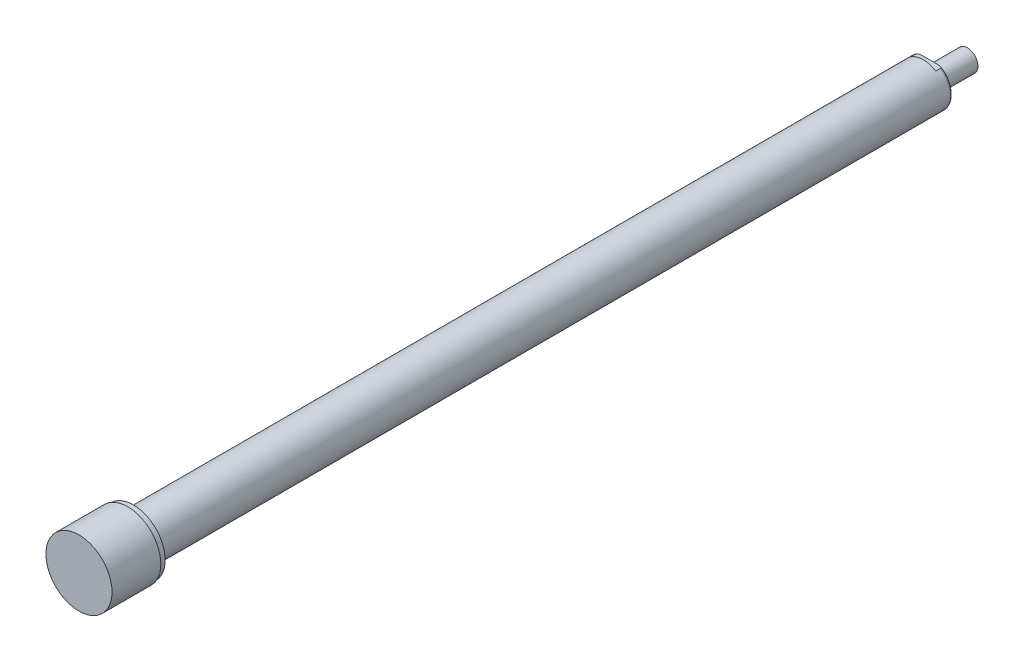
ISO-10303-21;
HEADER;
FILE_DESCRIPTION(('STEP AP214'),'2;1');
FILE_NAME('part.step','',(''),(''),'','','');
FILE_SCHEMA(('AUTOMOTIVE_DESIGN { 1 0 10303 214 1 1 1 1 }'));
ENDSEC;
DATA;
#1=APPLICATION_CONTEXT('core data for automotive mechanical design processes');
#2=APPLICATION_PROTOCOL_DEFINITION('international standard','automotive_design',2000,#1);
#3=PRODUCT_CONTEXT('',#1,'mechanical');
#4=PRODUCT('Part','Part','',(#3));
#5=PRODUCT_RELATED_PRODUCT_CATEGORY('part','',(#4));
#6=PRODUCT_DEFINITION_FORMATION('','',#4);
#7=PRODUCT_DEFINITION_CONTEXT('part definition',#1,'design');
#8=PRODUCT_DEFINITION('design','',#6,#7);
#9=PRODUCT_DEFINITION_SHAPE('','',#8);
#10=(LENGTH_UNIT() NAMED_UNIT(*) SI_UNIT(.MILLI.,.METRE.));
#11=(NAMED_UNIT(*) PLANE_ANGLE_UNIT() SI_UNIT($,.RADIAN.));
#12=(NAMED_UNIT(*) SI_UNIT($,.STERADIAN.) SOLID_ANGLE_UNIT());
#13=UNCERTAINTY_MEASURE_WITH_UNIT(LENGTH_MEASURE(1.E-05),#10,'distance_accuracy_value','');
#14=(GEOMETRIC_REPRESENTATION_CONTEXT(3) GLOBAL_UNCERTAINTY_ASSIGNED_CONTEXT((#13)) GLOBAL_UNIT_ASSIGNED_CONTEXT((#10,
#11,#12)) REPRESENTATION_CONTEXT('',''));
#15=CARTESIAN_POINT('',(0.,0.,0.));
#16=DIRECTION('',(0.,0.,1.));
#17=DIRECTION('',(1.,0.,0.));
#18=AXIS2_PLACEMENT_3D('',#15,#16,#17);
#19=CARTESIAN_POINT('',(0.,0.,2.55016));
#20=DIRECTION('',(0.,0.,1.));
#21=DIRECTION('',(1.,0.,0.));
#22=AXIS2_PLACEMENT_3D('',#19,#20,#21);
#23=PLANE('',#22);
#24=CARTESIAN_POINT('',(0.,0.,2.55016));
#25=DIRECTION('',(0.,0.,1.));
#26=DIRECTION('',(1.,0.,0.));
#27=AXIS2_PLACEMENT_3D('',#24,#25,#26);
#28=CIRCLE('',#27,24.765);
#29=CARTESIAN_POINT('',(24.765,0.,2.55016));
#30=VERTEX_POINT('',#29);
#31=EDGE_CURVE('E155',#30,#30,#28,.T.);
#32=ORIENTED_EDGE('',*,*,#31,.T.);
#33=EDGE_LOOP('',(#32));
#34=FACE_BOUND('',#33,.T.);
#35=ADVANCED_FACE('F16',(#34),#23,.T.);
#36=CARTESIAN_POINT('',(0.,0.,0.));
#37=DIRECTION('',(0.,0.,1.));
#38=DIRECTION('',(1.,0.,0.));
#39=AXIS2_PLACEMENT_3D('',#36,#37,#38);
#40=CYLINDRICAL_SURFACE('',#39,24.765);
#41=CARTESIAN_POINT('',(0.,0.,-34.));
#42=DIRECTION('',(0.,0.,1.));
#43=DIRECTION('',(1.,0.,0.));
#44=AXIS2_PLACEMENT_3D('',#41,#42,#43);
#45=CIRCLE('',#44,24.765);
#46=CARTESIAN_POINT('',(24.765,0.,-34.));
#47=VERTEX_POINT('',#46);
#48=EDGE_CURVE('E26',#47,#47,#45,.F.);
#49=ORIENTED_EDGE('',*,*,#48,.F.);
#50=EDGE_LOOP('',(#49));
#51=FACE_BOUND('',#50,.T.);
#52=ORIENTED_EDGE('',*,*,#31,.F.);
#53=EDGE_LOOP('',(#52));
#54=FACE_BOUND('',#53,.T.);
#55=ADVANCED_FACE('F164',(#51,#54),#40,.T.);
#56=CARTESIAN_POINT('',(0.,20.0152,-34.));
#57=DIRECTION('',(0.,0.,1.));
#58=DIRECTION('',(1.,0.,0.));
#59=AXIS2_PLACEMENT_3D('',#56,#57,#58);
#60=PLANE('',#59);
#61=CARTESIAN_POINT('',(0.,0.,-34.));
#62=DIRECTION('',(0.,0.,1.));
#63=DIRECTION('',(1.,0.,0.));
#64=AXIS2_PLACEMENT_3D('',#61,#62,#63);
#65=CIRCLE('',#64,23.876);
#66=CARTESIAN_POINT('',(23.876,0.,-34.));
#67=VERTEX_POINT('',#66);
#68=EDGE_CURVE('E10',#67,#67,#65,.T.);
#69=ORIENTED_EDGE('',*,*,#68,.T.);
#70=EDGE_LOOP('',(#69));
#71=FACE_BOUND('',#70,.T.);
#72=ORIENTED_EDGE('',*,*,#48,.T.);
#73=EDGE_LOOP('',(#72));
#74=FACE_BOUND('',#73,.T.);
#75=ADVANCED_FACE('F166',(#71,#74),#60,.F.);
#76=CARTESIAN_POINT('',(0.,8.,-663.3104));
#77=DIRECTION('',(0.,0.,-1.));
#78=DIRECTION('',(0.,1.,0.));
#79=AXIS2_PLACEMENT_3D('',#76,#77,#78);
#80=PLANE('',#79);
#81=CARTESIAN_POINT('',(0.,0.,-663.3104));
#82=DIRECTION('',(0.,0.,-1.));
#83=DIRECTION('',(0.,1.,0.));
#84=AXIS2_PLACEMENT_3D('',#81,#82,#83);
#85=CIRCLE('',#84,8.);
#86=CARTESIAN_POINT('',(0.,8.,-663.3104));
#87=VERTEX_POINT('',#86);
#88=EDGE_CURVE('E126',#87,#87,#85,.T.);
#89=ORIENTED_EDGE('',*,*,#88,.T.);
#90=EDGE_LOOP('',(#89));
#91=FACE_BOUND('',#90,.T.);
#92=ADVANCED_FACE('F114',(#91),#80,.T.);
#93=CARTESIAN_POINT('',(0.,0.,-663.3104));
#94=DIRECTION('',(0.,0.,-1.));
#95=DIRECTION('',(0.,1.,0.));
#96=AXIS2_PLACEMENT_3D('',#93,#94,#95);
#97=CYLINDRICAL_SURFACE('',#96,8.);
#98=CARTESIAN_POINT('',(0.,0.,-637.9104));
#99=DIRECTION('',(0.,0.,-1.));
#100=DIRECTION('',(0.,1.,0.));
#101=AXIS2_PLACEMENT_3D('',#98,#99,#100);
#102=CIRCLE('',#101,8.);
#103=CARTESIAN_POINT('',(0.,8.,-637.9104));
#104=VERTEX_POINT('',#103);
#105=EDGE_CURVE('E129',#104,#104,#102,.T.);
#106=ORIENTED_EDGE('',*,*,#105,.T.);
#107=EDGE_LOOP('',(#106));
#108=FACE_BOUND('',#107,.T.);
#109=ORIENTED_EDGE('',*,*,#88,.F.);
#110=EDGE_LOOP('',(#109));
#111=FACE_BOUND('',#110,.T.);
#112=ADVANCED_FACE('F218',(#108,#111),#97,.T.);
#113=CARTESIAN_POINT('',(0.,6.858,-637.9104));
#114=DIRECTION('',(0.,0.,1.));
#115=DIRECTION('',(0.,-1.,0.));
#116=AXIS2_PLACEMENT_3D('',#113,#114,#115);
#117=PLANE('',#116);
#118=CARTESIAN_POINT('',(0.,0.,-637.9104));
#119=DIRECTION('',(0.,0.,-1.));
#120=DIRECTION('',(0.,1.,0.));
#121=AXIS2_PLACEMENT_3D('',#118,#119,#120);
#122=CIRCLE('',#121,6.858);
#123=CARTESIAN_POINT('',(0.,6.858,-637.9104));
#124=VERTEX_POINT('',#123);
#125=EDGE_CURVE('E132',#124,#124,#122,.T.);
#126=ORIENTED_EDGE('',*,*,#125,.T.);
#127=EDGE_LOOP('',(#126));
#128=FACE_BOUND('',#127,.T.);
#129=ORIENTED_EDGE('',*,*,#105,.F.);
#130=EDGE_LOOP('',(#129));
#131=FACE_BOUND('',#130,.T.);
#132=ADVANCED_FACE('F212',(#128,#131),#117,.T.);
#133=CARTESIAN_POINT('',(0.,0.,-663.3104));
#134=DIRECTION('',(0.,0.,-1.));
#135=DIRECTION('',(0.,1.,0.));
#136=AXIS2_PLACEMENT_3D('',#133,#134,#135);
#137=CYLINDRICAL_SURFACE('',#136,6.858);
#138=CARTESIAN_POINT('',(0.,0.,-635.3704));
#139=DIRECTION('',(0.,0.,-1.));
#140=DIRECTION('',(0.,1.,0.));
#141=AXIS2_PLACEMENT_3D('',#138,#139,#140);
#142=CIRCLE('',#141,6.858);
#143=CARTESIAN_POINT('',(0.,6.858,-635.3704));
#144=VERTEX_POINT('',#143);
#145=EDGE_CURVE('E135',#144,#144,#142,.T.);
#146=ORIENTED_EDGE('',*,*,#145,.T.);
#147=EDGE_LOOP('',(#146));
#148=FACE_BOUND('',#147,.T.);
#149=ORIENTED_EDGE('',*,*,#125,.F.);
#150=EDGE_LOOP('',(#149));
#151=FACE_BOUND('',#150,.T.);
#152=ADVANCED_FACE('F206',(#148,#151),#137,.T.);
#153=CARTESIAN_POINT('',(0.,15.2125,-635.3704));
#154=DIRECTION('',(0.,0.,-1.));
#155=DIRECTION('',(0.,1.,0.));
#156=AXIS2_PLACEMENT_3D('',#153,#154,#155);
#157=PLANE('',#156);
#158=DIRECTION('',(-1.,0.,0.));
#159=VECTOR('',#158,1.);
#160=CARTESIAN_POINT('',(0.,14.,-635.3704));
#161=LINE('',#160,#159);
#162=CARTESIAN_POINT('',(5.95148353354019,14.,-635.3704));
#163=VERTEX_POINT('',#162);
#164=CARTESIAN_POINT('',(-5.95148353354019,14.,-635.3704));
#165=VERTEX_POINT('',#164);
#166=EDGE_CURVE('E21',#163,#165,#161,.T.);
#167=ORIENTED_EDGE('',*,*,#166,.F.);
#168=CARTESIAN_POINT('',(0.,0.,-635.3704));
#169=DIRECTION('',(0.,0.,-1.));
#170=DIRECTION('',(0.,1.,0.));
#171=AXIS2_PLACEMENT_3D('',#168,#169,#170);
#172=CIRCLE('',#171,15.2125);
#173=CARTESIAN_POINT('',(5.95148353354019,-14.,-635.3704));
#174=VERTEX_POINT('',#173);
#175=EDGE_CURVE('E138',#163,#174,#172,.T.);
#176=ORIENTED_EDGE('',*,*,#175,.T.);
#177=DIRECTION('',(1.,0.,0.));
#178=VECTOR('',#177,1.);
#179=CARTESIAN_POINT('',(0.,-14.,-635.3704));
#180=LINE('',#179,#178);
#181=CARTESIAN_POINT('',(-5.95148353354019,-14.,-635.3704));
#182=VERTEX_POINT('',#181);
#183=EDGE_CURVE('E144',#182,#174,#180,.T.);
#184=ORIENTED_EDGE('',*,*,#183,.F.);
#185=EDGE_CURVE('E139',#182,#165,#172,.T.);
#186=ORIENTED_EDGE('',*,*,#185,.T.);
#187=EDGE_LOOP('',(#167,#176,#184,#186));
#188=FACE_BOUND('',#187,.T.);
#189=ORIENTED_EDGE('',*,*,#145,.F.);
#190=EDGE_LOOP('',(#189));
#191=FACE_BOUND('',#190,.T.);
#192=ADVANCED_FACE('F200',(#188,#191),#157,.T.);
#193=CARTESIAN_POINT('',(0.,0.,-630.2904));
#194=DIRECTION('',(0.,0.,-1.));
#195=DIRECTION('',(-1.,0.,0.));
#196=AXIS2_PLACEMENT_3D('',#193,#194,#195);
#197=PLANE('',#196);
#198=CARTESIAN_POINT('',(0.,0.,-630.2904));
#199=DIRECTION('',(0.,0.,-1.));
#200=DIRECTION('',(-1.,0.,0.));
#201=AXIS2_PLACEMENT_3D('',#198,#199,#200);
#202=CIRCLE('',#201,16.8);
#203=CARTESIAN_POINT('',(-9.28654941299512,14.,-630.2904));
#204=VERTEX_POINT('',#203);
#205=CARTESIAN_POINT('',(9.28654941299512,14.,-630.2904));
#206=VERTEX_POINT('',#205);
#207=EDGE_CURVE('E73',#204,#206,#202,.T.);
#208=ORIENTED_EDGE('',*,*,#207,.T.);
#209=DIRECTION('',(-1.,0.,0.));
#210=VECTOR('',#209,1.);
#211=CARTESIAN_POINT('',(9.28654941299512,14.,-630.2904));
#212=LINE('',#211,#210);
#213=EDGE_CURVE('E76',#206,#204,#212,.T.);
#214=ORIENTED_EDGE('',*,*,#213,.T.);
#215=EDGE_LOOP('',(#208,#214));
#216=FACE_BOUND('',#215,.T.);
#217=ADVANCED_FACE('F75',(#216),#197,.T.);
#218=CARTESIAN_POINT('',(0.,0.,-633.7829));
#219=DIRECTION('',(0.,0.,-1.));
#220=DIRECTION('',(0.,1.,0.));
#221=AXIS2_PLACEMENT_3D('',#218,#219,#220);
#222=TOROIDAL_SURFACE('',#221,15.2125,1.5875);
#223=CARTESIAN_POINT('',(0.,14.,-634.807595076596));
#224=CARTESIAN_POINT('',(-0.13276803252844,14.,-634.807593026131));
#225=CARTESIAN_POINT('',(-0.265533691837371,14.,-634.809844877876));
#226=CARTESIAN_POINT('',(-0.530924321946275,14.,-634.818671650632));
#227=CARTESIAN_POINT('',(-0.663549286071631,14.,-634.825246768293));
#228=CARTESIAN_POINT('',(-1.06113740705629,14.,-634.85082076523));
#229=CARTESIAN_POINT('',(-1.32572041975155,14.,-634.875667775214));
#230=CARTESIAN_POINT('',(-1.85467558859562,14.,-634.935304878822));
#231=CARTESIAN_POINT('',(-2.11904315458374,14.,-634.97013225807));
#232=CARTESIAN_POINT('',(-2.64722640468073,14.,-635.043362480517));
#233=CARTESIAN_POINT('',(-2.91104215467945,14.,-635.08176486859));
#234=CARTESIAN_POINT('',(-3.34668840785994,14.,-635.143564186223));
#235=CARTESIAN_POINT('',(-3.51843693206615,14.,-635.16751393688));
#236=CARTESIAN_POINT('',(-3.86222256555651,14.,-635.21322682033));
#237=CARTESIAN_POINT('',(-4.03425968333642,14.,-635.234989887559));
#238=CARTESIAN_POINT('',(-4.55096879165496,14.,-635.295020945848));
#239=CARTESIAN_POINT('',(-4.89633775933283,14.,-635.328046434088));
#240=CARTESIAN_POINT('',(-5.4324845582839,14.,-635.359635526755));
#241=CARTESIAN_POINT('',(-5.62271612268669,14.,-635.367024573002));
#242=CARTESIAN_POINT('',(-6.00342493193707,14.,-635.371964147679));
#243=CARTESIAN_POINT('',(-6.19390224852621,14.,-635.369510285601));
#244=CARTESIAN_POINT('',(-6.57443040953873,14.,-635.35206589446));
#245=CARTESIAN_POINT('',(-6.76448114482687,14.,-635.337072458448));
#246=CARTESIAN_POINT('',(-7.04800150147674,14.,-635.302528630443));
#247=CARTESIAN_POINT('',(-7.14221305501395,14.,-635.289012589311));
#248=CARTESIAN_POINT('',(-7.32985530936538,14.,-635.257394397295));
#249=CARTESIAN_POINT('',(-7.42328618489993,14.,-635.239293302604));
#250=CARTESIAN_POINT('',(-7.60981224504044,14.,-635.197657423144));
#251=CARTESIAN_POINT('',(-7.70289714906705,14.,-635.174075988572));
#252=CARTESIAN_POINT('',(-7.88726094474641,14.,-635.12074825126));
#253=CARTESIAN_POINT('',(-7.97854070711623,14.,-635.09100500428));
#254=CARTESIAN_POINT('',(-8.15800808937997,14.,-635.024496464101));
#255=CARTESIAN_POINT('',(-8.2462091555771,14.,-634.987767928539));
#256=CARTESIAN_POINT('',(-8.41861308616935,14.,-634.905991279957));
#257=CARTESIAN_POINT('',(-8.50282110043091,14.,-634.860954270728));
#258=CARTESIAN_POINT('',(-8.64739637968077,14.,-634.772038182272));
#259=CARTESIAN_POINT('',(-8.70893575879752,14.,-634.730080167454));
#260=CARTESIAN_POINT('',(-8.82695536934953,14.,-634.639330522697));
#261=CARTESIAN_POINT('',(-8.88342980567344,14.,-634.590531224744));
#262=CARTESIAN_POINT('',(-8.98963579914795,14.,-634.484856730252));
#263=CARTESIAN_POINT('',(-9.03928619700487,14.,-634.427898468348));
#264=CARTESIAN_POINT('',(-9.12777987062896,14.,-634.3061116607));
#265=CARTESIAN_POINT('',(-9.16665238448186,14.,-634.241305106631));
#266=CARTESIAN_POINT('',(-9.22003745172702,14.,-634.125711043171));
#267=CARTESIAN_POINT('',(-9.23836397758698,14.,-634.076688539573));
#268=CARTESIAN_POINT('',(-9.26663253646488,14.,-633.976274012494));
#269=CARTESIAN_POINT('',(-9.27658176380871,14.,-633.92488406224));
#270=CARTESIAN_POINT('',(-9.28727482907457,14.,-633.82094216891));
#271=CARTESIAN_POINT('',(-9.28798383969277,14.,-633.76838657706));
#272=CARTESIAN_POINT('',(-9.28004044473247,14.,-633.66398713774));
#273=CARTESIAN_POINT('',(-9.27138562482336,14.,-633.612143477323));
#274=CARTESIAN_POINT('',(-9.24609238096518,14.,-633.513096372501));
#275=CARTESIAN_POINT('',(-9.22985055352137,14.,-633.465789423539));
#276=CARTESIAN_POINT('',(-9.19066177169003,14.,-633.374071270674));
#277=CARTESIAN_POINT('',(-9.16771223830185,14.,-633.329661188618));
#278=CARTESIAN_POINT('',(-9.10285320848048,14.,-633.221841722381));
#279=CARTESIAN_POINT('',(-9.05730159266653,14.,-633.160624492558));
#280=CARTESIAN_POINT('',(-8.95711629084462,14.,-633.04613877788));
#281=CARTESIAN_POINT('',(-8.90245884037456,14.,-632.992891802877));
#282=CARTESIAN_POINT('',(-8.75205778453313,14.,-632.863960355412));
#283=CARTESIAN_POINT('',(-8.65138838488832,14.,-632.794065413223));
#284=CARTESIAN_POINT('',(-8.44094705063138,14.,-632.669906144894));
#285=CARTESIAN_POINT('',(-8.33115456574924,14.,-632.615678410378));
#286=CARTESIAN_POINT('',(-8.11312892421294,14.,-632.522886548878));
#287=CARTESIAN_POINT('',(-8.00521018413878,14.,-632.483567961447));
#288=CARTESIAN_POINT('',(-7.78638225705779,14.,-632.414218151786));
#289=CARTESIAN_POINT('',(-7.67547044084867,14.,-632.38419540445));
#290=CARTESIAN_POINT('',(-7.45172845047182,14.,-632.33194530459));
#291=CARTESIAN_POINT('',(-7.33889625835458,14.,-632.309726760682));
#292=CARTESIAN_POINT('',(-7.11210332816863,14.,-632.271935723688));
#293=CARTESIAN_POINT('',(-6.99814217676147,14.,-632.256365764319));
#294=CARTESIAN_POINT('',(-6.76357841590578,14.,-632.230250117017));
#295=CARTESIAN_POINT('',(-6.64294221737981,14.,-632.220012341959));
#296=CARTESIAN_POINT('',(-6.40132401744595,14.,-632.204929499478));
#297=CARTESIAN_POINT('',(-6.28034194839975,14.,-632.20008557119));
#298=CARTESIAN_POINT('',(-5.9170673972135,14.,-632.192460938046));
#299=CARTESIAN_POINT('',(-5.67462782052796,14.,-632.196605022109));
#300=CARTESIAN_POINT('',(-5.18958172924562,14.,-632.218383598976));
#301=CARTESIAN_POINT('',(-4.94697788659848,14.,-632.236067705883));
#302=CARTESIAN_POINT('',(-4.46281479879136,14.,-632.280899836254));
#303=CARTESIAN_POINT('',(-4.22125506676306,14.,-632.308042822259));
#304=CARTESIAN_POINT('',(-3.66652722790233,14.,-632.377108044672));
#305=CARTESIAN_POINT('',(-3.35361868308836,14.,-632.42102115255));
#306=CARTESIAN_POINT('',(-2.72786060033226,14.,-632.510386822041));
#307=CARTESIAN_POINT('',(-2.41501121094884,14.,-632.555840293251));
#308=CARTESIAN_POINT('',(-1.79091906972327,14.,-632.638284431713));
#309=CARTESIAN_POINT('',(-1.47968696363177,14.,-632.675347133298));
#310=CARTESIAN_POINT('',(-1.01173384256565,14.,-632.717283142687));
#311=CARTESIAN_POINT('',(-0.855647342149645,14.,-632.728982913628));
#312=CARTESIAN_POINT('',(-0.543154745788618,14.,-632.746808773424));
#313=CARTESIAN_POINT('',(-0.386748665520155,14.,-632.752935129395));
#314=CARTESIAN_POINT('',(-0.0729452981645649,14.,-632.759018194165));
#315=CARTESIAN_POINT('',(0.084452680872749,14.,-632.758940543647));
#316=CARTESIAN_POINT('',(0.399120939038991,14.,-632.752538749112));
#317=CARTESIAN_POINT('',(0.5563912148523,14.,-632.746214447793));
#318=CARTESIAN_POINT('',(0.870747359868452,14.,-632.727945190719));
#319=CARTESIAN_POINT('',(1.0278329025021,14.,-632.715994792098));
#320=CARTESIAN_POINT('',(1.34159739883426,14.,-632.687550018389));
#321=CARTESIAN_POINT('',(1.49827630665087,14.,-632.671055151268));
#322=CARTESIAN_POINT('',(1.81316576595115,14.,-632.634583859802));
#323=CARTESIAN_POINT('',(1.97137154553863,14.,-632.614567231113));
#324=CARTESIAN_POINT('',(2.28750928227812,14.,-632.572537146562));
#325=CARTESIAN_POINT('',(2.4454412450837,14.,-632.550523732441));
#326=CARTESIAN_POINT('',(2.91891159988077,14.,-632.483449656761));
#327=CARTESIAN_POINT('',(3.23429351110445,14.,-632.437332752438));
#328=CARTESIAN_POINT('',(3.866969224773,14.,-632.351141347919));
#329=CARTESIAN_POINT('',(4.18426592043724,14.,-632.31108632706));
#330=CARTESIAN_POINT('',(4.66160221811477,14.,-632.261907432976));
#331=CARTESIAN_POINT('',(4.82106369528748,14.,-632.247325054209));
#332=CARTESIAN_POINT('',(5.14034359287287,14.,-632.222922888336));
#333=CARTESIAN_POINT('',(5.30016197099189,14.,-632.213102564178));
#334=CARTESIAN_POINT('',(5.61795638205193,14.,-632.199521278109));
#335=CARTESIAN_POINT('',(5.77592887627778,14.,-632.195682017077));
#336=CARTESIAN_POINT('',(6.09195057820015,14.,-632.19514758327));
#337=CARTESIAN_POINT('',(6.24999979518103,14.,-632.198454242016));
#338=CARTESIAN_POINT('',(6.56527224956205,14.,-632.213786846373));
#339=CARTESIAN_POINT('',(6.72249656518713,14.,-632.225789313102));
#340=CARTESIAN_POINT('',(7.03573124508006,14.,-632.260441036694));
#341=CARTESIAN_POINT('',(7.19174244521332,14.,-632.283082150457));
#342=CARTESIAN_POINT('',(7.41615197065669,14.,-632.325489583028));
#343=CARTESIAN_POINT('',(7.48555710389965,14.,-632.339991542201));
#344=CARTESIAN_POINT('',(7.62369369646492,14.,-632.371975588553));
#345=CARTESIAN_POINT('',(7.69242507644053,14.,-632.389458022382));
#346=CARTESIAN_POINT('',(7.82924857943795,14.,-632.427814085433));
#347=CARTESIAN_POINT('',(7.89733687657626,14.,-632.448701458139));
#348=CARTESIAN_POINT('',(8.03225786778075,14.,-632.494211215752));
#349=CARTESIAN_POINT('',(8.09909066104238,14.,-632.518833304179));
#350=CARTESIAN_POINT('',(8.23194606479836,14.,-632.572631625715));
#351=CARTESIAN_POINT('',(8.29794618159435,14.,-632.601863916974));
#352=CARTESIAN_POINT('',(8.4276184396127,14.,-632.665218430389));
#353=CARTESIAN_POINT('',(8.49128951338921,14.,-632.699342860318));
#354=CARTESIAN_POINT('',(8.61506191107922,14.,-632.77292848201));
#355=CARTESIAN_POINT('',(8.67517993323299,14.,-632.812361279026));
#356=CARTESIAN_POINT('',(8.79087032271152,14.,-632.897343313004));
#357=CARTESIAN_POINT('',(8.84644896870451,14.,-632.942883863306));
#358=CARTESIAN_POINT('',(8.94548291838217,14.,-633.035317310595));
#359=CARTESIAN_POINT('',(8.98959902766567,14.,-633.081494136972));
#360=CARTESIAN_POINT('',(9.07112763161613,14.,-633.179534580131));
#361=CARTESIAN_POINT('',(9.10853908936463,14.,-633.231399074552));
#362=CARTESIAN_POINT('',(9.17478487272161,14.,-633.341313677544));
#363=CARTESIAN_POINT('',(9.2035104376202,14.,-633.399430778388));
#364=CARTESIAN_POINT('',(9.24908813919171,14.,-633.520152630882));
#365=CARTESIAN_POINT('',(9.26596285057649,14.,-633.582748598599));
#366=CARTESIAN_POINT('',(9.28464960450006,14.,-633.702335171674));
#367=CARTESIAN_POINT('',(9.28804963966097,14.,-633.75907661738));
#368=CARTESIAN_POINT('',(9.28382966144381,14.,-633.872145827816));
#369=CARTESIAN_POINT('',(9.27621073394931,14.,-633.92847363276));
#370=CARTESIAN_POINT('',(9.25229003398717,14.,-634.032102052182));
#371=CARTESIAN_POINT('',(9.23713577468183,14.,-634.079676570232));
#372=CARTESIAN_POINT('',(9.19997892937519,14.,-634.172038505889));
#373=CARTESIAN_POINT('',(9.1779746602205,14.,-634.216825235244));
#374=CARTESIAN_POINT('',(9.11609014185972,14.,-634.324302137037));
#375=CARTESIAN_POINT('',(9.07273694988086,14.,-634.384990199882));
#376=CARTESIAN_POINT('',(8.97697606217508,14.,-634.498741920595));
#377=CARTESIAN_POINT('',(8.92454537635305,14.,-634.551785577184));
#378=CARTESIAN_POINT('',(8.78073012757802,14.,-634.679735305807));
#379=CARTESIAN_POINT('',(8.68454281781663,14.,-634.749202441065));
#380=CARTESIAN_POINT('',(8.48303059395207,14.,-634.873115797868));
#381=CARTESIAN_POINT('',(8.37768429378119,14.,-634.927525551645));
#382=CARTESIAN_POINT('',(8.16908427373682,14.,-635.020673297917));
#383=CARTESIAN_POINT('',(8.06619117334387,14.,-635.060235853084));
#384=CARTESIAN_POINT('',(7.85737031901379,14.,-635.130483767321));
#385=CARTESIAN_POINT('',(7.75143986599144,14.,-635.161160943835));
#386=CARTESIAN_POINT('',(7.53762663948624,14.,-635.215024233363));
#387=CARTESIAN_POINT('',(7.42974224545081,14.,-635.238203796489));
#388=CARTESIAN_POINT('',(7.2128718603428,14.,-635.278141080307));
#389=CARTESIAN_POINT('',(7.10388648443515,14.,-635.294902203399));
#390=CARTESIAN_POINT('',(6.89130219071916,14.,-635.322143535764));
#391=CARTESIAN_POINT('',(6.78774054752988,14.,-635.332921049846));
#392=CARTESIAN_POINT('',(6.58025497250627,14.,-635.350196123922));
#393=CARTESIAN_POINT('',(6.47633098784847,14.,-635.356693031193));
#394=CARTESIAN_POINT('',(6.16416768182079,14.,-635.370589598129));
#395=CARTESIAN_POINT('',(5.95567421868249,14.,-635.372379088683));
#396=CARTESIAN_POINT('',(5.53835436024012,14.,-635.36450473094));
#397=CARTESIAN_POINT('',(5.3295288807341,14.,-635.354806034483));
#398=CARTESIAN_POINT('',(4.91243398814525,14.,-635.326724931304));
#399=CARTESIAN_POINT('',(4.70416474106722,14.,-635.308340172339));
#400=CARTESIAN_POINT('',(4.28654719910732,14.,-635.265186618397));
#401=CARTESIAN_POINT('',(4.07720452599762,14.,-635.240365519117));
#402=CARTESIAN_POINT('',(3.65905089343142,14.,-635.186814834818));
#403=CARTESIAN_POINT('',(3.45023989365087,14.,-635.158085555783));
#404=CARTESIAN_POINT('',(3.03316786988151,14.,-635.099210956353));
#405=CARTESIAN_POINT('',(2.82490650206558,14.,-635.069067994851));
#406=CARTESIAN_POINT('',(2.4082260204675,14.,-635.009971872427));
#407=CARTESIAN_POINT('',(2.19980692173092,14.,-634.981018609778));
#408=CARTESIAN_POINT('',(1.82558056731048,14.,-634.932810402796));
#409=CARTESIAN_POINT('',(1.65987471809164,14.,-634.912788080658));
#410=CARTESIAN_POINT('',(1.32795613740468,14.,-634.876904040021));
#411=CARTESIAN_POINT('',(1.16174328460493,14.,-634.861043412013));
#412=CARTESIAN_POINT('',(0.829734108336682,14.,-634.835025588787));
#413=CARTESIAN_POINT('',(0.663940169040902,14.,-634.824838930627));
#414=CARTESIAN_POINT('',(0.332096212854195,14.,-634.811125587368));
#415=CARTESIAN_POINT('',(0.166046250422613,14.,-634.807597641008));
#416=CARTESIAN_POINT('',(0.,14.,-634.807595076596));
#417=B_SPLINE_CURVE_WITH_KNOTS('',3,(#223,#224,#225,#226,#227,#228,#229,#230,#231,#232,#233,
#234,#235,#236,#237,#238,#239,#240,#241,#242,#243,#244,#245,#246,#247,#248,#249,#250,#251,#252,
#253,#254,#255,#256,#257,#258,#259,#260,#261,#262,#263,#264,#265,#266,#267,#268,#269,#270,#271,
#272,#273,#274,#275,#276,#277,#278,#279,#280,#281,#282,#283,#284,#285,#286,#287,#288,#289,#290,
#291,#292,#293,#294,#295,#296,#297,#298,#299,#300,#301,#302,#303,#304,#305,#306,#307,#308,#309,
#310,#311,#312,#313,#314,#315,#316,#317,#318,#319,#320,#321,#322,#323,#324,#325,#326,#327,#328,
#329,#330,#331,#332,#333,#334,#335,#336,#337,#338,#339,#340,#341,#342,#343,#344,#345,#346,#347,
#348,#349,#350,#351,#352,#353,#354,#355,#356,#357,#358,#359,#360,#361,#362,#363,#364,#365,#366,
#367,#368,#369,#370,#371,#372,#373,#374,#375,#376,#377,#378,#379,#380,#381,#382,#383,#384,#385,
#386,#387,#388,#389,#390,#391,#392,#393,#394,#395,#396,#397,#398,#399,#400,#401,#402,#403,#404,
#405,#406,#407,#408,#409,#410,#411,#412,#413,#414,#415,#416),.UNSPECIFIED.,.T.,.F.,(4,2,2,2,2,2,
2,2,2,2,2,2,2,2,2,2,2,2,2,2,2,2,2,2,2,2,2,2,2,2,2,2,2,2,2,2,2,2,2,2,2,2,2,2,2,2,2,2,2,2,2,2,2,2,
2,2,2,2,2,2,2,2,2,2,2,2,2,2,2,2,2,2,2,2,2,2,2,2,2,2,2,2,2,2,2,2,2,2,2,2,2,2,2,2,2,2,4),(0.,
0.3982817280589,0.796581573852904,1.59346088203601,2.39335695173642,3.19315132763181,
3.71336857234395,4.23360141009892,5.27376582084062,5.84469365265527,6.41587617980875,
6.98719115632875,7.27262913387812,7.55800141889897,7.84589809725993,8.13365234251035,
8.41993230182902,8.70583240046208,8.92889552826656,9.15221070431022,9.37798665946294,
9.60314400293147,9.75952095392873,9.91576347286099,10.0725947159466,10.2294664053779,
10.3789250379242,10.5284412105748,10.7560526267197,10.9842676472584,11.3498680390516,
11.7163155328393,12.0603788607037,12.4047549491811,12.7495184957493,13.0944133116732,
13.4574784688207,13.8206202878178,14.547448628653,15.2769530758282,16.0060696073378,
16.9539379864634,17.9023761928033,18.8423341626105,19.3118216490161,19.7812866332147,
20.2533518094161,20.7254288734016,21.1979635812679,21.6705494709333,22.1489292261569,
22.627298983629,23.5835269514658,24.5427652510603,25.0230897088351,25.5033599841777,
25.9772884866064,26.4513384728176,26.92411326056,27.3965267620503,27.6091866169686,
27.8218712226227,28.0354365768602,28.2489849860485,28.4653650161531,28.6818430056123,
28.8972059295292,29.1122657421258,29.3033629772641,29.4944897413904,29.6879190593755,
29.8809789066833,30.050458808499,30.2199220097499,30.3691164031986,30.5183474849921,
30.7408251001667,30.9638746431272,31.3178265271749,31.6726282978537,32.0028505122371,
32.3333758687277,32.6641891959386,32.9948269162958,33.3070886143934,33.6193979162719,
34.2444298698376,34.8713626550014,35.4984653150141,36.1308331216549,36.763151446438,
37.3944498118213,38.0256940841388,38.5263936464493,39.0272242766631,39.5254294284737,
40.0235402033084),.UNSPECIFIED.);
#418=CARTESIAN_POINT('',(9.28654941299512,14.,-633.7829));
#419=VERTEX_POINT('',#418);
#420=EDGE_CURVE('E34',#419,#163,#417,.T.);
#421=ORIENTED_EDGE('',*,*,#420,.F.);
#422=CARTESIAN_POINT('',(0.,0.,-633.7829));
#423=DIRECTION('',(0.,0.,-1.));
#424=DIRECTION('',(0.,1.,0.));
#425=AXIS2_PLACEMENT_3D('',#422,#423,#424);
#426=CIRCLE('',#425,16.8);
#427=CARTESIAN_POINT('',(9.28654941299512,-14.,-633.7829));
#428=VERTEX_POINT('',#427);
#429=EDGE_CURVE('E88',#419,#428,#426,.T.);
#430=ORIENTED_EDGE('',*,*,#429,.T.);
#431=CARTESIAN_POINT('',(0.,-14.,-634.807595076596));
#432=CARTESIAN_POINT('',(0.13276803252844,-14.,-634.807593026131));
#433=CARTESIAN_POINT('',(0.265533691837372,-14.,-634.809844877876));
#434=CARTESIAN_POINT('',(0.530924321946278,-14.,-634.818671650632));
#435=CARTESIAN_POINT('',(0.663549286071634,-14.,-634.825246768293));
#436=CARTESIAN_POINT('',(1.0611374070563,-14.,-634.85082076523));
#437=CARTESIAN_POINT('',(1.32572041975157,-14.,-634.875667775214));
#438=CARTESIAN_POINT('',(1.85467558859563,-14.,-634.935304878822));
#439=CARTESIAN_POINT('',(2.11904315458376,-14.,-634.97013225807));
#440=CARTESIAN_POINT('',(2.64722640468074,-14.,-635.043362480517));
#441=CARTESIAN_POINT('',(2.91104215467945,-14.,-635.08176486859));
#442=CARTESIAN_POINT('',(3.34668840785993,-14.,-635.143564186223));
#443=CARTESIAN_POINT('',(3.51843693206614,-14.,-635.16751393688));
#444=CARTESIAN_POINT('',(3.86222256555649,-14.,-635.21322682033));
#445=CARTESIAN_POINT('',(4.0342596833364,-14.,-635.234989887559));
#446=CARTESIAN_POINT('',(4.55096879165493,-14.,-635.295020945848));
#447=CARTESIAN_POINT('',(4.89633775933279,-14.,-635.328046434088));
#448=CARTESIAN_POINT('',(5.43248455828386,-14.,-635.359635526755));
#449=CARTESIAN_POINT('',(5.62271612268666,-14.,-635.367024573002));
#450=CARTESIAN_POINT('',(6.00342493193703,-14.,-635.371964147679));
#451=CARTESIAN_POINT('',(6.19390224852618,-14.,-635.369510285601));
#452=CARTESIAN_POINT('',(6.5744304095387,-14.,-635.35206589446));
#453=CARTESIAN_POINT('',(6.76448114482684,-14.,-635.337072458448));
#454=CARTESIAN_POINT('',(7.04800150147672,-14.,-635.302528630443));
#455=CARTESIAN_POINT('',(7.14221305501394,-14.,-635.289012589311));
#456=CARTESIAN_POINT('',(7.32985530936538,-14.,-635.257394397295));
#457=CARTESIAN_POINT('',(7.42328618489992,-14.,-635.239293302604));
#458=CARTESIAN_POINT('',(7.60981224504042,-14.,-635.197657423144));
#459=CARTESIAN_POINT('',(7.70289714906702,-14.,-635.174075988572));
#460=CARTESIAN_POINT('',(7.88726094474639,-14.,-635.12074825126));
#461=CARTESIAN_POINT('',(7.97854070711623,-14.,-635.09100500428));
#462=CARTESIAN_POINT('',(8.15800808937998,-14.,-635.024496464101));
#463=CARTESIAN_POINT('',(8.2462091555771,-14.,-634.987767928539));
#464=CARTESIAN_POINT('',(8.41861308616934,-14.,-634.905991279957));
#465=CARTESIAN_POINT('',(8.50282110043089,-14.,-634.860954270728));
#466=CARTESIAN_POINT('',(8.64739637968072,-14.,-634.772038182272));
#467=CARTESIAN_POINT('',(8.70893575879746,-14.,-634.730080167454));
#468=CARTESIAN_POINT('',(8.82695536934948,-14.,-634.639330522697));
#469=CARTESIAN_POINT('',(8.88342980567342,-14.,-634.590531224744));
#470=CARTESIAN_POINT('',(8.98963579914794,-14.,-634.484856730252));
#471=CARTESIAN_POINT('',(9.03928619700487,-14.,-634.427898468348));
#472=CARTESIAN_POINT('',(9.12777987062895,-14.,-634.3061116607));
#473=CARTESIAN_POINT('',(9.16665238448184,-14.,-634.241305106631));
#474=CARTESIAN_POINT('',(9.22003745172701,-14.,-634.125711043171));
#475=CARTESIAN_POINT('',(9.23836397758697,-14.,-634.076688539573));
#476=CARTESIAN_POINT('',(9.26663253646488,-14.,-633.976274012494));
#477=CARTESIAN_POINT('',(9.27658176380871,-14.,-633.92488406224));
#478=CARTESIAN_POINT('',(9.28727482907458,-14.,-633.82094216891));
#479=CARTESIAN_POINT('',(9.28798383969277,-14.,-633.76838657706));
#480=CARTESIAN_POINT('',(9.28004044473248,-14.,-633.66398713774));
#481=CARTESIAN_POINT('',(9.27138562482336,-14.,-633.612143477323));
#482=CARTESIAN_POINT('',(9.24609238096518,-14.,-633.513096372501));
#483=CARTESIAN_POINT('',(9.22985055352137,-14.,-633.465789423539));
#484=CARTESIAN_POINT('',(9.19066177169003,-14.,-633.374071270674));
#485=CARTESIAN_POINT('',(9.16771223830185,-14.,-633.329661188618));
#486=CARTESIAN_POINT('',(9.10285320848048,-14.,-633.221841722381));
#487=CARTESIAN_POINT('',(9.05730159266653,-14.,-633.160624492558));
#488=CARTESIAN_POINT('',(8.95711629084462,-14.,-633.04613877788));
#489=CARTESIAN_POINT('',(8.90245884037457,-14.,-632.992891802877));
#490=CARTESIAN_POINT('',(8.75205778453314,-14.,-632.863960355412));
#491=CARTESIAN_POINT('',(8.65138838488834,-14.,-632.794065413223));
#492=CARTESIAN_POINT('',(8.4409470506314,-14.,-632.669906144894));
#493=CARTESIAN_POINT('',(8.33115456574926,-14.,-632.615678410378));
#494=CARTESIAN_POINT('',(8.11312892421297,-14.,-632.522886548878));
#495=CARTESIAN_POINT('',(8.00521018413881,-14.,-632.483567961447));
#496=CARTESIAN_POINT('',(7.78638225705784,-14.,-632.414218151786));
#497=CARTESIAN_POINT('',(7.67547044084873,-14.,-632.38419540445));
#498=CARTESIAN_POINT('',(7.45172845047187,-14.,-632.33194530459));
#499=CARTESIAN_POINT('',(7.33889625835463,-14.,-632.309726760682));
#500=CARTESIAN_POINT('',(7.11210332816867,-14.,-632.271935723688));
#501=CARTESIAN_POINT('',(6.99814217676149,-14.,-632.256365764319));
#502=CARTESIAN_POINT('',(6.76357841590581,-14.,-632.230250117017));
#503=CARTESIAN_POINT('',(6.64294221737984,-14.,-632.220012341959));
#504=CARTESIAN_POINT('',(6.40132401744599,-14.,-632.204929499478));
#505=CARTESIAN_POINT('',(6.28034194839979,-14.,-632.20008557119));
#506=CARTESIAN_POINT('',(5.91706739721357,-14.,-632.192460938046));
#507=CARTESIAN_POINT('',(5.67462782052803,-14.,-632.196605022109));
#508=CARTESIAN_POINT('',(5.18958172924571,-14.,-632.218383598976));
#509=CARTESIAN_POINT('',(4.94697788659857,-14.,-632.236067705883));
#510=CARTESIAN_POINT('',(4.46281479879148,-14.,-632.280899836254));
#511=CARTESIAN_POINT('',(4.2212550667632,-14.,-632.308042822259));
#512=CARTESIAN_POINT('',(3.66652722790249,-14.,-632.377108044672));
#513=CARTESIAN_POINT('',(3.35361868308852,-14.,-632.42102115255));
#514=CARTESIAN_POINT('',(2.72786060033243,-14.,-632.51038682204));
#515=CARTESIAN_POINT('',(2.41501121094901,-14.,-632.555840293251));
#516=CARTESIAN_POINT('',(1.79091906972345,-14.,-632.638284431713));
#517=CARTESIAN_POINT('',(1.47968696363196,-14.,-632.675347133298));
#518=CARTESIAN_POINT('',(1.01173384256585,-14.,-632.717283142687));
#519=CARTESIAN_POINT('',(0.855647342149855,-14.,-632.728982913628));
#520=CARTESIAN_POINT('',(0.543154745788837,-14.,-632.746808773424));
#521=CARTESIAN_POINT('',(0.386748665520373,-14.,-632.752935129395));
#522=CARTESIAN_POINT('',(0.0729452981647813,-14.,-632.759018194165));
#523=CARTESIAN_POINT('',(-0.0844526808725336,-14.,-632.758940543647));
#524=CARTESIAN_POINT('',(-0.399120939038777,-14.,-632.752538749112));
#525=CARTESIAN_POINT('',(-0.556391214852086,-14.,-632.746214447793));
#526=CARTESIAN_POINT('',(-0.870747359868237,-14.,-632.727945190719));
#527=CARTESIAN_POINT('',(-1.02783290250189,-14.,-632.715994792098));
#528=CARTESIAN_POINT('',(-1.34159739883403,-14.,-632.687550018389));
#529=CARTESIAN_POINT('',(-1.49827630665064,-14.,-632.671055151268));
#530=CARTESIAN_POINT('',(-1.81316576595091,-14.,-632.634583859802));
#531=CARTESIAN_POINT('',(-1.97137154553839,-14.,-632.614567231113));
#532=CARTESIAN_POINT('',(-2.28750928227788,-14.,-632.572537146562));
#533=CARTESIAN_POINT('',(-2.44544124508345,-14.,-632.550523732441));
#534=CARTESIAN_POINT('',(-2.9189115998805,-14.,-632.483449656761));
#535=CARTESIAN_POINT('',(-3.23429351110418,-14.,-632.437332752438));
#536=CARTESIAN_POINT('',(-3.86696922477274,-14.,-632.351141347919));
#537=CARTESIAN_POINT('',(-4.18426592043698,-14.,-632.31108632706));
#538=CARTESIAN_POINT('',(-4.6616022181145,-14.,-632.261907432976));
#539=CARTESIAN_POINT('',(-4.82106369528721,-14.,-632.247325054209));
#540=CARTESIAN_POINT('',(-5.14034359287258,-14.,-632.222922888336));
#541=CARTESIAN_POINT('',(-5.3001619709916,-14.,-632.213102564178));
#542=CARTESIAN_POINT('',(-5.61795638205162,-14.,-632.199521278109));
#543=CARTESIAN_POINT('',(-5.77592887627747,-14.,-632.195682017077));
#544=CARTESIAN_POINT('',(-6.09195057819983,-14.,-632.19514758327));
#545=CARTESIAN_POINT('',(-6.2499997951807,-14.,-632.198454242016));
#546=CARTESIAN_POINT('',(-6.56527224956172,-14.,-632.213786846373));
#547=CARTESIAN_POINT('',(-6.7224965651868,-14.,-632.225789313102));
#548=CARTESIAN_POINT('',(-7.03573124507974,-14.,-632.260441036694));
#549=CARTESIAN_POINT('',(-7.19174244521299,-14.,-632.283082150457));
#550=CARTESIAN_POINT('',(-7.41615197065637,-14.,-632.325489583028));
#551=CARTESIAN_POINT('',(-7.48555710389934,-14.,-632.339991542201));
#552=CARTESIAN_POINT('',(-7.62369369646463,-14.,-632.371975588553));
#553=CARTESIAN_POINT('',(-7.69242507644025,-14.,-632.389458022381));
#554=CARTESIAN_POINT('',(-7.82924857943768,-14.,-632.427814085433));
#555=CARTESIAN_POINT('',(-7.89733687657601,-14.,-632.448701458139));
#556=CARTESIAN_POINT('',(-8.0322578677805,-14.,-632.494211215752));
#557=CARTESIAN_POINT('',(-8.09909066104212,-14.,-632.518833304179));
#558=CARTESIAN_POINT('',(-8.23194606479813,-14.,-632.572631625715));
#559=CARTESIAN_POINT('',(-8.29794618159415,-14.,-632.601863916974));
#560=CARTESIAN_POINT('',(-8.42761843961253,-14.,-632.665218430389));
#561=CARTESIAN_POINT('',(-8.49128951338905,-14.,-632.699342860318));
#562=CARTESIAN_POINT('',(-8.61506191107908,-14.,-632.77292848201));
#563=CARTESIAN_POINT('',(-8.67517993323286,-14.,-632.812361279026));
#564=CARTESIAN_POINT('',(-8.79087032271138,-14.,-632.897343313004));
#565=CARTESIAN_POINT('',(-8.84644896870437,-14.,-632.942883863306));
#566=CARTESIAN_POINT('',(-8.94548291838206,-14.,-633.035317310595));
#567=CARTESIAN_POINT('',(-8.98959902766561,-14.,-633.081494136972));
#568=CARTESIAN_POINT('',(-9.07112763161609,-14.,-633.179534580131));
#569=CARTESIAN_POINT('',(-9.10853908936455,-14.,-633.231399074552));
#570=CARTESIAN_POINT('',(-9.17478487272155,-14.,-633.341313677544));
#571=CARTESIAN_POINT('',(-9.20351043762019,-14.,-633.399430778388));
#572=CARTESIAN_POINT('',(-9.24908813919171,-14.,-633.520152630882));
#573=CARTESIAN_POINT('',(-9.26596285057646,-14.,-633.582748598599));
#574=CARTESIAN_POINT('',(-9.28464960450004,-14.,-633.702335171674));
#575=CARTESIAN_POINT('',(-9.28804963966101,-14.,-633.75907661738));
#576=CARTESIAN_POINT('',(-9.28382966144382,-14.,-633.872145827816));
#577=CARTESIAN_POINT('',(-9.27621073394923,-14.,-633.928473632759));
#578=CARTESIAN_POINT('',(-9.2522900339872,-14.,-634.032102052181));
#579=CARTESIAN_POINT('',(-9.23713577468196,-14.,-634.079676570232));
#580=CARTESIAN_POINT('',(-9.19997892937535,-14.,-634.172038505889));
#581=CARTESIAN_POINT('',(-9.17797466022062,-14.,-634.216825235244));
#582=CARTESIAN_POINT('',(-9.11609014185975,-14.,-634.324302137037));
#583=CARTESIAN_POINT('',(-9.07273694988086,-14.,-634.384990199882));
#584=CARTESIAN_POINT('',(-8.97697606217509,-14.,-634.498741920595));
#585=CARTESIAN_POINT('',(-8.92454537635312,-14.,-634.551785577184));
#586=CARTESIAN_POINT('',(-8.78073012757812,-14.,-634.679735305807));
#587=CARTESIAN_POINT('',(-8.68454281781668,-14.,-634.749202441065));
#588=CARTESIAN_POINT('',(-8.48303059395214,-14.,-634.873115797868));
#589=CARTESIAN_POINT('',(-8.37768429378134,-14.,-634.927525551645));
#590=CARTESIAN_POINT('',(-8.16908427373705,-14.,-635.020673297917));
#591=CARTESIAN_POINT('',(-8.0661911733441,-14.,-635.060235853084));
#592=CARTESIAN_POINT('',(-7.85737031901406,-14.,-635.130483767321));
#593=CARTESIAN_POINT('',(-7.75143986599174,-14.,-635.161160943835));
#594=CARTESIAN_POINT('',(-7.53762663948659,-14.,-635.215024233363));
#595=CARTESIAN_POINT('',(-7.42974224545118,-14.,-635.238203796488));
#596=CARTESIAN_POINT('',(-7.21287186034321,-14.,-635.278141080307));
#597=CARTESIAN_POINT('',(-7.10388648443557,-14.,-635.294902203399));
#598=CARTESIAN_POINT('',(-6.89130219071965,-14.,-635.322143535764));
#599=CARTESIAN_POINT('',(-6.78774054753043,-14.,-635.332921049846));
#600=CARTESIAN_POINT('',(-6.58025497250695,-14.,-635.350196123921));
#601=CARTESIAN_POINT('',(-6.4763309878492,-14.,-635.356693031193));
#602=CARTESIAN_POINT('',(-6.1641676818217,-14.,-635.370589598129));
#603=CARTESIAN_POINT('',(-5.95567421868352,-14.,-635.372379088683));
#604=CARTESIAN_POINT('',(-5.53835436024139,-14.,-635.36450473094));
#605=CARTESIAN_POINT('',(-5.32952888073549,-14.,-635.354806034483));
#606=CARTESIAN_POINT('',(-4.91243398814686,-14.,-635.326724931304));
#607=CARTESIAN_POINT('',(-4.70416474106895,-14.,-635.308340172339));
#608=CARTESIAN_POINT('',(-4.28654719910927,-14.,-635.265186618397));
#609=CARTESIAN_POINT('',(-4.07720452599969,-14.,-635.240365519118));
#610=CARTESIAN_POINT('',(-3.65905089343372,-14.,-635.186814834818));
#611=CARTESIAN_POINT('',(-3.45023989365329,-14.,-635.158085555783));
#612=CARTESIAN_POINT('',(-3.03316786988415,-14.,-635.099210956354));
#613=CARTESIAN_POINT('',(-2.82490650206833,-14.,-635.069067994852));
#614=CARTESIAN_POINT('',(-2.40822602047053,-14.,-635.009971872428));
#615=CARTESIAN_POINT('',(-2.19980692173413,-14.,-634.981018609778));
#616=CARTESIAN_POINT('',(-1.82558056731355,-14.,-634.932810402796));
#617=CARTESIAN_POINT('',(-1.65987471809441,-14.,-634.912788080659));
#618=CARTESIAN_POINT('',(-1.32795613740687,-14.,-634.876904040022));
#619=CARTESIAN_POINT('',(-1.16174328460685,-14.,-634.861043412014));
#620=CARTESIAN_POINT('',(-0.829734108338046,-14.,-634.835025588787));
#621=CARTESIAN_POINT('',(-0.663940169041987,-14.,-634.824838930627));
#622=CARTESIAN_POINT('',(-0.332096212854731,-14.,-634.811125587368));
#623=CARTESIAN_POINT('',(-0.166046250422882,-14.,-634.807597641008));
#624=CARTESIAN_POINT('',(0.,-14.,-634.807595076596));
#625=B_SPLINE_CURVE_WITH_KNOTS('',3,(#431,#432,#433,#434,#435,#436,#437,#438,#439,#440,#441,
#442,#443,#444,#445,#446,#447,#448,#449,#450,#451,#452,#453,#454,#455,#456,#457,#458,#459,#460,
#461,#462,#463,#464,#465,#466,#467,#468,#469,#470,#471,#472,#473,#474,#475,#476,#477,#478,#479,
#480,#481,#482,#483,#484,#485,#486,#487,#488,#489,#490,#491,#492,#493,#494,#495,#496,#497,#498,
#499,#500,#501,#502,#503,#504,#505,#506,#507,#508,#509,#510,#511,#512,#513,#514,#515,#516,#517,
#518,#519,#520,#521,#522,#523,#524,#525,#526,#527,#528,#529,#530,#531,#532,#533,#534,#535,#536,
#537,#538,#539,#540,#541,#542,#543,#544,#545,#546,#547,#548,#549,#550,#551,#552,#553,#554,#555,
#556,#557,#558,#559,#560,#561,#562,#563,#564,#565,#566,#567,#568,#569,#570,#571,#572,#573,#574,
#575,#576,#577,#578,#579,#580,#581,#582,#583,#584,#585,#586,#587,#588,#589,#590,#591,#592,#593,
#594,#595,#596,#597,#598,#599,#600,#601,#602,#603,#604,#605,#606,#607,#608,#609,#610,#611,#612,
#613,#614,#615,#616,#617,#618,#619,#620,#621,#622,#623,#624),.UNSPECIFIED.,.T.,.F.,(4,2,2,2,2,2,
2,2,2,2,2,2,2,2,2,2,2,2,2,2,2,2,2,2,2,2,2,2,2,2,2,2,2,2,2,2,2,2,2,2,2,2,2,2,2,2,2,2,2,2,2,2,2,2,
2,2,2,2,2,2,2,2,2,2,2,2,2,2,2,2,2,2,2,2,2,2,2,2,2,2,2,2,2,2,2,2,2,2,2,2,2,2,2,2,2,2,4),(0.,
0.398281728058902,0.796581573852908,1.59346088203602,2.39335695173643,3.19315132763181,
3.71336857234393,4.23360141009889,5.27376582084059,5.84469365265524,6.41587617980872,
6.98719115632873,7.27262913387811,7.55800141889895,7.8458980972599,8.13365234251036,
8.41993230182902,8.70583240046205,8.9288955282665,9.15221070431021,9.37798665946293,
9.60314400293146,9.75952095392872,9.91576347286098,10.0725947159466,10.2294664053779,
10.3789250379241,10.5284412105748,10.7560526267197,10.9842676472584,11.3498680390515,
11.7163155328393,12.0603788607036,12.404754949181,12.7495184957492,13.0944133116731,
13.4574784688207,13.8206202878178,14.5474486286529,15.2769530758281,16.0060696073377,
16.9539379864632,17.9023761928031,18.8423341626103,19.3118216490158,19.7812866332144,
20.2533518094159,20.7254288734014,21.1979635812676,21.6705494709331,22.1489292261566,
22.6272989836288,23.5835269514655,24.54276525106,25.0230897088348,25.5033599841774,
25.9772884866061,26.4513384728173,26.9241132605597,27.39652676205,27.6091866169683,
27.8218712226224,28.0354365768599,28.2489849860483,28.4653650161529,28.6818430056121,
28.897205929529,29.1122657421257,29.303362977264,29.4944897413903,29.6879190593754,
29.8809789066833,30.0504588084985,30.2199220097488,30.3691164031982,30.518347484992,
30.7408251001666,30.963874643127,31.3178265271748,31.6726282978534,32.0028505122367,
32.3333758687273,32.6641891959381,32.9948269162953,33.3070886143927,33.619397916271,
34.2444298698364,34.8713626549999,35.4984653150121,36.1308331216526,36.7631514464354,
37.3944498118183,38.0256940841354,38.5263936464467,39.0272242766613,39.5254294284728,
40.0235402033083),.UNSPECIFIED.);
#626=EDGE_CURVE('E122',#174,#428,#625,.T.);
#627=ORIENTED_EDGE('',*,*,#626,.F.);
#628=ORIENTED_EDGE('',*,*,#175,.F.);
#629=EDGE_LOOP('',(#421,#430,#627,#628));
#630=FACE_BOUND('',#629,.T.);
#631=ADVANCED_FACE('F18',(#630),#222,.T.);
#632=CARTESIAN_POINT('',(0.,0.,-630.2904));
#633=DIRECTION('',(0.,0.,-1.));
#634=DIRECTION('',(-1.,0.,0.));
#635=AXIS2_PLACEMENT_3D('',#632,#633,#634);
#636=PLANE('',#635);
#637=CARTESIAN_POINT('',(0.,0.,-630.2904));
#638=DIRECTION('',(0.,0.,-1.));
#639=DIRECTION('',(-1.,0.,0.));
#640=AXIS2_PLACEMENT_3D('',#637,#638,#639);
#641=CIRCLE('',#640,16.8);
#642=CARTESIAN_POINT('',(9.28654941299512,-14.,-630.2904));
#643=VERTEX_POINT('',#642);
#644=CARTESIAN_POINT('',(-9.28654941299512,-14.,-630.2904));
#645=VERTEX_POINT('',#644);
#646=EDGE_CURVE('E98',#643,#645,#641,.T.);
#647=ORIENTED_EDGE('',*,*,#646,.T.);
#648=DIRECTION('',(1.,0.,0.));
#649=VECTOR('',#648,1.);
#650=CARTESIAN_POINT('',(9.28654941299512,-14.,-630.2904));
#651=LINE('',#650,#649);
#652=EDGE_CURVE('E368',#645,#643,#651,.T.);
#653=ORIENTED_EDGE('',*,*,#652,.T.);
#654=EDGE_LOOP('',(#647,#653));
#655=FACE_BOUND('',#654,.T.);
#656=ADVANCED_FACE('F105',(#655),#636,.T.);
#657=CARTESIAN_POINT('',(9.28654941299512,-14.,-630.2904));
#658=DIRECTION('',(0.,1.,0.));
#659=DIRECTION('',(0.,0.,1.));
#660=AXIS2_PLACEMENT_3D('',#657,#658,#659);
#661=PLANE('',#660);
#662=ORIENTED_EDGE('',*,*,#626,.T.);
#663=DIRECTION('',(0.,0.,-1.));
#664=VECTOR('',#663,1.);
#665=CARTESIAN_POINT('',(9.28654941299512,-14.,-630.2904));
#666=LINE('',#665,#664);
#667=EDGE_CURVE('E123',#643,#428,#666,.T.);
#668=ORIENTED_EDGE('',*,*,#667,.F.);
#669=ORIENTED_EDGE('',*,*,#652,.F.);
#670=DIRECTION('',(0.,0.,-1.));
#671=VECTOR('',#670,1.);
#672=CARTESIAN_POINT('',(-9.28654941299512,-14.,-630.2904));
#673=LINE('',#672,#671);
#674=CARTESIAN_POINT('',(-9.28654941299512,-14.,-633.7829));
#675=VERTEX_POINT('',#674);
#676=EDGE_CURVE('E124',#645,#675,#673,.T.);
#677=ORIENTED_EDGE('',*,*,#676,.T.);
#678=EDGE_CURVE('E42',#675,#182,#625,.T.);
#679=ORIENTED_EDGE('',*,*,#678,.T.);
#680=ORIENTED_EDGE('',*,*,#183,.T.);
#681=EDGE_LOOP('',(#662,#668,#669,#677,#679,#680));
#682=FACE_BOUND('',#681,.T.);
#683=ADVANCED_FACE('F109',(#682),#661,.F.);
#684=CARTESIAN_POINT('',(-9.28654941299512,14.,-633.7829));
#685=VERTEX_POINT('',#684);
#686=EDGE_CURVE('E97',#165,#685,#417,.T.);
#687=ORIENTED_EDGE('',*,*,#686,.F.);
#688=ORIENTED_EDGE('',*,*,#185,.F.);
#689=ORIENTED_EDGE('',*,*,#678,.F.);
#690=EDGE_CURVE('E142',#675,#685,#426,.T.);
#691=ORIENTED_EDGE('',*,*,#690,.T.);
#692=EDGE_LOOP('',(#687,#688,#689,#691));
#693=FACE_BOUND('',#692,.T.);
#694=ADVANCED_FACE('F104',(#693),#222,.T.);
#695=CARTESIAN_POINT('',(9.28654941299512,14.,-630.2904));
#696=DIRECTION('',(0.,-1.,0.));
#697=DIRECTION('',(0.,0.,-1.));
#698=AXIS2_PLACEMENT_3D('',#695,#696,#697);
#699=PLANE('',#698);
#700=ORIENTED_EDGE('',*,*,#686,.T.);
#701=DIRECTION('',(0.,0.,-1.));
#702=VECTOR('',#701,1.);
#703=CARTESIAN_POINT('',(-9.28654941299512,14.,-630.2904));
#704=LINE('',#703,#702);
#705=EDGE_CURVE('E83',#204,#685,#704,.T.);
#706=ORIENTED_EDGE('',*,*,#705,.F.);
#707=ORIENTED_EDGE('',*,*,#213,.F.);
#708=DIRECTION('',(0.,0.,-1.));
#709=VECTOR('',#708,1.);
#710=CARTESIAN_POINT('',(9.28654941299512,14.,-630.2904));
#711=LINE('',#710,#709);
#712=EDGE_CURVE('E82',#206,#419,#711,.T.);
#713=ORIENTED_EDGE('',*,*,#712,.T.);
#714=ORIENTED_EDGE('',*,*,#420,.T.);
#715=ORIENTED_EDGE('',*,*,#166,.T.);
#716=EDGE_LOOP('',(#700,#706,#707,#713,#714,#715));
#717=FACE_BOUND('',#716,.T.);
#718=ADVANCED_FACE('F81',(#717),#699,.F.);
#719=CARTESIAN_POINT('',(0.,0.,-34.));
#720=DIRECTION('',(0.,0.,-1.));
#721=DIRECTION('',(-1.,0.,0.));
#722=AXIS2_PLACEMENT_3D('',#719,#720,#721);
#723=CYLINDRICAL_SURFACE('',#722,16.8);
#724=CARTESIAN_POINT('',(0.,0.,-38.191));
#725=DIRECTION('',(0.,0.,1.));
#726=DIRECTION('',(1.,0.,0.));
#727=AXIS2_PLACEMENT_3D('',#724,#725,#726);
#728=CIRCLE('',#727,16.8);
#729=CARTESIAN_POINT('',(16.8,0.,-38.191));
#730=VERTEX_POINT('',#729);
#731=EDGE_CURVE('E150',#730,#730,#728,.T.);
#732=ORIENTED_EDGE('',*,*,#731,.F.);
#733=EDGE_LOOP('',(#732));
#734=FACE_BOUND('',#733,.T.);
#735=ORIENTED_EDGE('',*,*,#705,.T.);
#736=ORIENTED_EDGE('',*,*,#690,.F.);
#737=ORIENTED_EDGE('',*,*,#676,.F.);
#738=ORIENTED_EDGE('',*,*,#646,.F.);
#739=ORIENTED_EDGE('',*,*,#667,.T.);
#740=ORIENTED_EDGE('',*,*,#429,.F.);
#741=ORIENTED_EDGE('',*,*,#712,.F.);
#742=ORIENTED_EDGE('',*,*,#207,.F.);
#743=EDGE_LOOP('',(#735,#736,#737,#738,#739,#740,#741,#742));
#744=FACE_BOUND('',#743,.T.);
#745=ADVANCED_FACE('F86',(#734,#744),#723,.T.);
#746=CARTESIAN_POINT('',(0.,0.,-38.191));
#747=DIRECTION('',(0.,0.,1.));
#748=DIRECTION('',(1.,0.,0.));
#749=AXIS2_PLACEMENT_3D('',#746,#747,#748);
#750=PLANE('',#749);
#751=ORIENTED_EDGE('',*,*,#731,.T.);
#752=EDGE_LOOP('',(#751));
#753=FACE_BOUND('',#752,.T.);
#754=CARTESIAN_POINT('',(0.,0.,-38.191));
#755=DIRECTION('',(0.,0.,1.));
#756=DIRECTION('',(1.,0.,0.));
#757=AXIS2_PLACEMENT_3D('',#754,#755,#756);
#758=CIRCLE('',#757,23.876);
#759=CARTESIAN_POINT('',(23.876,0.,-38.191));
#760=VERTEX_POINT('',#759);
#761=EDGE_CURVE('E147',#760,#760,#758,.T.);
#762=ORIENTED_EDGE('',*,*,#761,.F.);
#763=EDGE_LOOP('',(#762));
#764=FACE_BOUND('',#763,.T.);
#765=ADVANCED_FACE('F177',(#753,#764),#750,.F.);
#766=CARTESIAN_POINT('',(0.,0.,-34.));
#767=DIRECTION('',(0.,0.,-1.));
#768=DIRECTION('',(-1.,0.,0.));
#769=AXIS2_PLACEMENT_3D('',#766,#767,#768);
#770=CYLINDRICAL_SURFACE('',#769,23.876);
#771=ORIENTED_EDGE('',*,*,#68,.F.);
#772=EDGE_LOOP('',(#771));
#773=FACE_BOUND('',#772,.T.);
#774=ORIENTED_EDGE('',*,*,#761,.T.);
#775=EDGE_LOOP('',(#774));
#776=FACE_BOUND('',#775,.T.);
#777=ADVANCED_FACE('F185',(#773,#776),#770,.T.);
#778=CLOSED_SHELL('',(#35,#55,#75,#92,#112,#132,#152,#192,#217,#631,#656,#683,#694,#718,#745,
#765,#777));
#779=MANIFOLD_SOLID_BREP('B1',#778);
#780=ADVANCED_BREP_SHAPE_REPRESENTATION('',(#18,#779),#14);
#781=SHAPE_DEFINITION_REPRESENTATION(#9,#780);
ENDSEC;
END-ISO-10303-21;
